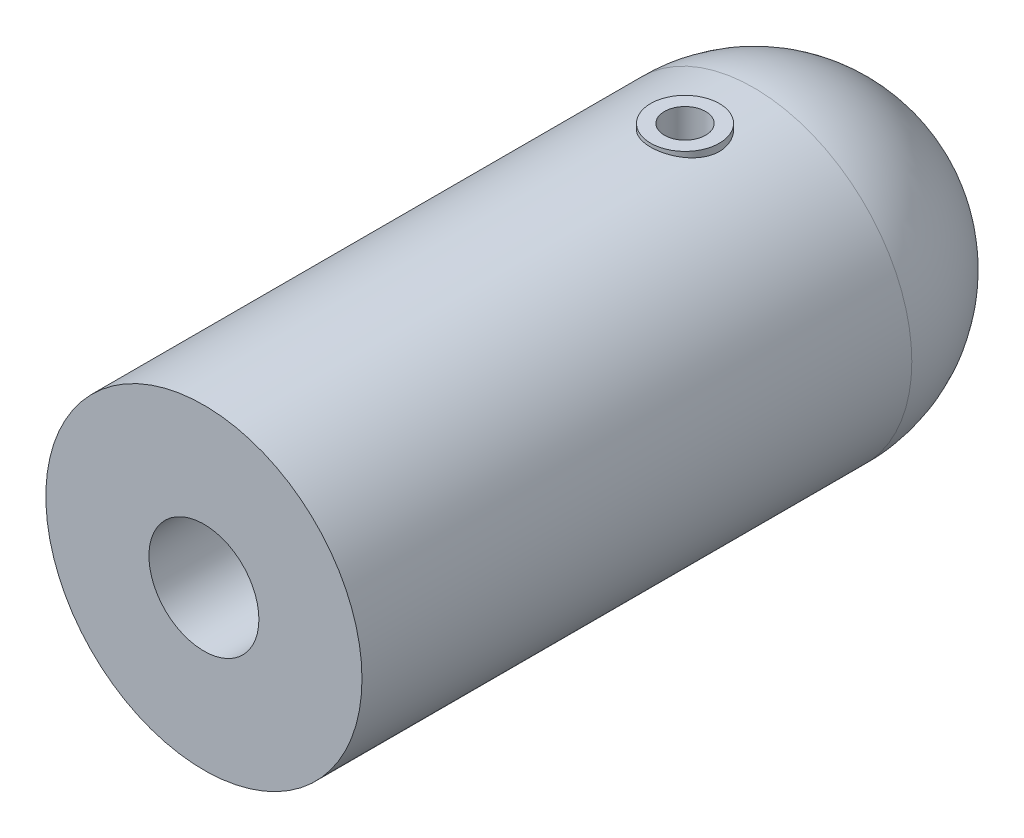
ISO-10303-21;
HEADER;
FILE_DESCRIPTION(('STEP AP214'),'2;1');
FILE_NAME('part.step','',(''),(''),'','','');
FILE_SCHEMA(('AUTOMOTIVE_DESIGN { 1 0 10303 214 1 1 1 1 }'));
ENDSEC;
DATA;
#1=APPLICATION_CONTEXT('core data for automotive mechanical design processes');
#2=APPLICATION_PROTOCOL_DEFINITION('international standard','automotive_design',2000,#1);
#3=PRODUCT_CONTEXT('',#1,'mechanical');
#4=PRODUCT('Part','Part','',(#3));
#5=PRODUCT_RELATED_PRODUCT_CATEGORY('part','',(#4));
#6=PRODUCT_DEFINITION_FORMATION('','',#4);
#7=PRODUCT_DEFINITION_CONTEXT('part definition',#1,'design');
#8=PRODUCT_DEFINITION('design','',#6,#7);
#9=PRODUCT_DEFINITION_SHAPE('','',#8);
#10=(LENGTH_UNIT() NAMED_UNIT(*) SI_UNIT(.MILLI.,.METRE.));
#11=(NAMED_UNIT(*) PLANE_ANGLE_UNIT() SI_UNIT($,.RADIAN.));
#12=(NAMED_UNIT(*) SI_UNIT($,.STERADIAN.) SOLID_ANGLE_UNIT());
#13=UNCERTAINTY_MEASURE_WITH_UNIT(LENGTH_MEASURE(1.E-05),#10,'distance_accuracy_value','');
#14=(GEOMETRIC_REPRESENTATION_CONTEXT(3) GLOBAL_UNCERTAINTY_ASSIGNED_CONTEXT((#13)) GLOBAL_UNIT_ASSIGNED_CONTEXT((#10,
#11,#12)) REPRESENTATION_CONTEXT('',''));
#15=CARTESIAN_POINT('',(0.,0.,0.));
#16=DIRECTION('',(0.,0.,1.));
#17=DIRECTION('',(1.,0.,0.));
#18=AXIS2_PLACEMENT_3D('',#15,#16,#17);
#19=CARTESIAN_POINT('',(0.,0.,80.));
#20=DIRECTION('',(0.,0.,-1.));
#21=DIRECTION('',(-1.,0.,0.));
#22=AXIS2_PLACEMENT_3D('',#19,#20,#21);
#23=CYLINDRICAL_SURFACE('',#22,23.);
#24=CARTESIAN_POINT('',(0.,0.,0.));
#25=DIRECTION('',(0.,0.,1.));
#26=DIRECTION('',(1.,0.,0.));
#27=AXIS2_PLACEMENT_3D('',#24,#25,#26);
#28=CIRCLE('',#27,23.);
#29=CARTESIAN_POINT('',(23.,0.,0.));
#30=VERTEX_POINT('',#29);
#31=EDGE_CURVE('E67',#30,#30,#28,.T.);
#32=ORIENTED_EDGE('',*,*,#31,.T.);
#33=EDGE_LOOP('',(#32));
#34=FACE_BOUND('',#33,.T.);
#35=CARTESIAN_POINT('',(0.,0.,80.));
#36=DIRECTION('',(0.,0.,1.));
#37=DIRECTION('',(1.,0.,0.));
#38=AXIS2_PLACEMENT_3D('',#35,#36,#37);
#39=CIRCLE('',#38,23.);
#40=CARTESIAN_POINT('',(23.,0.,80.));
#41=VERTEX_POINT('',#40);
#42=EDGE_CURVE('E41',#41,#41,#39,.T.);
#43=ORIENTED_EDGE('',*,*,#42,.F.);
#44=EDGE_LOOP('',(#43));
#45=FACE_BOUND('',#44,.T.);
#46=CARTESIAN_POINT('',(0.,23.,15.));
#47=CARTESIAN_POINT('',(0.277355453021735,22.9999948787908,14.9999904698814));
#48=CARTESIAN_POINT('',(0.554826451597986,22.9949320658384,14.9768442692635));
#49=CARTESIAN_POINT('',(1.10188982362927,22.9752244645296,14.8849654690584));
#50=CARTESIAN_POINT('',(1.37147637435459,22.9605727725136,14.8162000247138));
#51=CARTESIAN_POINT('',(1.89478531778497,22.9233191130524,14.6353360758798));
#52=CARTESIAN_POINT('',(2.14852386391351,22.9007254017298,14.523282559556));
#53=CARTESIAN_POINT('',(2.63358953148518,22.8500275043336,14.2591653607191));
#54=CARTESIAN_POINT('',(2.86491728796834,22.8219234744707,14.1071028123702));
#55=CARTESIAN_POINT('',(3.30227374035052,22.7627863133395,13.7647311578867));
#56=CARTESIAN_POINT('',(3.50789604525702,22.7317172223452,13.5739090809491));
#57=CARTESIAN_POINT('',(3.8844813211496,22.6704056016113,13.1605364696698));
#58=CARTESIAN_POINT('',(4.05544123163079,22.6401631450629,12.9379831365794));
#59=CARTESIAN_POINT('',(4.35963714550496,22.5835746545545,12.4644667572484));
#60=CARTESIAN_POINT('',(4.49244139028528,22.557274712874,12.2132203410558));
#61=CARTESIAN_POINT('',(4.7137868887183,22.5120647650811,11.6913104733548));
#62=CARTESIAN_POINT('',(4.8023333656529,22.4931538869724,11.4206493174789));
#63=CARTESIAN_POINT('',(4.93130849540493,22.4652292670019,10.8719987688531));
#64=CARTESIAN_POINT('',(4.97245619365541,22.4560677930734,10.5941860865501));
#65=CARTESIAN_POINT('',(5.00770133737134,22.4482355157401,10.0354611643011));
#66=CARTESIAN_POINT('',(5.00180449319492,22.4495634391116,9.75454930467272));
#67=CARTESIAN_POINT('',(4.94370678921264,22.462426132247,9.20293933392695));
#68=CARTESIAN_POINT('',(4.89234041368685,22.473776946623,8.93214839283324));
#69=CARTESIAN_POINT('',(4.74608346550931,22.5051157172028,8.40312176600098));
#70=CARTESIAN_POINT('',(4.65119047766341,22.5251041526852,8.14488677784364));
#71=CARTESIAN_POINT('',(4.41980547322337,22.5716477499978,7.64595211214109));
#72=CARTESIAN_POINT('',(4.28299185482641,22.5982533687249,7.40540648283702));
#73=CARTESIAN_POINT('',(3.97187541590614,22.6550024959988,6.95037821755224));
#74=CARTESIAN_POINT('',(3.79756754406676,22.685146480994,6.73589909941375));
#75=CARTESIAN_POINT('',(3.41198948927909,22.7463657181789,6.33428694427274));
#76=CARTESIAN_POINT('',(3.20000952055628,22.7774471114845,6.14783562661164));
#77=CARTESIAN_POINT('',(2.74743924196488,22.8364526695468,5.81301931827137));
#78=CARTESIAN_POINT('',(2.50684842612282,22.8643767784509,5.66465500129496));
#79=CARTESIAN_POINT('',(2.00305938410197,22.9140103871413,5.41005890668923));
#80=CARTESIAN_POINT('',(1.73981507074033,22.9357068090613,5.30391561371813));
#81=CARTESIAN_POINT('',(1.19865085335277,22.9703430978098,5.13755845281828));
#82=CARTESIAN_POINT('',(0.920733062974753,22.9832842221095,5.07733798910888));
#83=CARTESIAN_POINT('',(0.363959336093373,22.998773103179,5.0055255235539));
#84=CARTESIAN_POINT('',(0.0852289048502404,23.0015198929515,4.99300216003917));
#85=CARTESIAN_POINT('',(-0.470341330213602,22.9968679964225,5.01441617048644));
#86=CARTESIAN_POINT('',(-0.747181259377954,22.9894699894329,5.04835043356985));
#87=CARTESIAN_POINT('',(-1.28803214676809,22.965485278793,5.16094402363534));
#88=CARTESIAN_POINT('',(-1.55214947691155,22.9489988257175,5.23911563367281));
#89=CARTESIAN_POINT('',(-2.06352339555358,22.908682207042,5.43742418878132));
#90=CARTESIAN_POINT('',(-2.31077855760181,22.8848514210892,5.55756467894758));
#91=CARTESIAN_POINT('',(-2.78526633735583,22.8319982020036,5.83834667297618));
#92=CARTESIAN_POINT('',(-3.01216677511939,22.8029071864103,5.99953632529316));
#93=CARTESIAN_POINT('',(-3.43603237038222,22.7429019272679,6.35711834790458));
#94=CARTESIAN_POINT('',(-3.63299368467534,22.7119874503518,6.55351523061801));
#95=CARTESIAN_POINT('',(-3.99506577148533,22.6511332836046,6.98020810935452));
#96=CARTESIAN_POINT('',(-4.15953201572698,22.6212215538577,7.21105574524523));
#97=CARTESIAN_POINT('',(-4.44736358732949,22.5664022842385,7.69764303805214));
#98=CARTESIAN_POINT('',(-4.57073068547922,22.5414945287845,7.95338162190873));
#99=CARTESIAN_POINT('',(-4.7720341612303,22.4997392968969,8.48112433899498));
#100=CARTESIAN_POINT('',(-4.8502247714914,22.4828468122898,8.75302776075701));
#101=CARTESIAN_POINT('',(-4.95970263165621,22.4589524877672,9.30652786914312));
#102=CARTESIAN_POINT('',(-4.99099727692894,22.4519490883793,9.58812302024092));
#103=CARTESIAN_POINT('',(-5.00548311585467,22.448723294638,10.1465166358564));
#104=CARTESIAN_POINT('',(-4.98969596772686,22.4522719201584,10.4232877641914));
#105=CARTESIAN_POINT('',(-4.91274819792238,22.4692329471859,10.9701251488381));
#106=CARTESIAN_POINT('',(-4.85158809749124,22.482645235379,11.2401914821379));
#107=CARTESIAN_POINT('',(-4.68612139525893,22.5177114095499,11.7651534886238));
#108=CARTESIAN_POINT('',(-4.5819617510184,22.5393372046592,12.0200974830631));
#109=CARTESIAN_POINT('',(-4.33357956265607,22.5884050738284,12.5090440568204));
#110=CARTESIAN_POINT('',(-4.1893529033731,22.6158477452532,12.7430444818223));
#111=CARTESIAN_POINT('',(-3.86153463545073,22.6741425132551,13.1885016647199));
#112=CARTESIAN_POINT('',(-3.67721419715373,22.7050517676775,13.3994146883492));
#113=CARTESIAN_POINT('',(-3.27591964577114,22.7664110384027,13.7876521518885));
#114=CARTESIAN_POINT('',(-3.05893799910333,22.796860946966,13.9649688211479));
#115=CARTESIAN_POINT('',(-2.59513904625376,22.8543320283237,14.283147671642));
#116=CARTESIAN_POINT('',(-2.34797586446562,22.8813044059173,14.4235149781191));
#117=CARTESIAN_POINT('',(-1.83303166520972,22.9282925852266,14.6604916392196));
#118=CARTESIAN_POINT('',(-1.56526825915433,22.948314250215,14.7571378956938));
#119=CARTESIAN_POINT('',(-1.08101000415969,22.9755491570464,14.8865936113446));
#120=CARTESIAN_POINT('',(-0.867145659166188,22.9846616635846,14.9290402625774));
#121=CARTESIAN_POINT('',(-0.435544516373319,22.9968889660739,14.9857465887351));
#122=CARTESIAN_POINT('',(-0.217807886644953,23.0000040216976,15.0000074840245));
#123=CARTESIAN_POINT('',(0.,23.,15.));
#124=B_SPLINE_CURVE_WITH_KNOTS('',3,(#46,#47,#48,#49,#50,#51,#52,#53,#54,#55,#56,#57,#58,#59,
#60,#61,#62,#63,#64,#65,#66,#67,#68,#69,#70,#71,#72,#73,#74,#75,#76,#77,#78,#79,#80,#81,#82,#83,
#84,#85,#86,#87,#88,#89,#90,#91,#92,#93,#94,#95,#96,#97,#98,#99,#100,#101,#102,#103,#104,#105,
#106,#107,#108,#109,#110,#111,#112,#113,#114,#115,#116,#117,#118,#119,#120,#121,#122,#123),
.UNSPECIFIED.,.T.,.F.,(4,2,2,2,2,2,2,2,2,2,2,2,2,2,2,2,2,2,2,2,2,2,2,2,2,2,2,2,2,2,2,2,2,2,2,2,
2,2,4),(0.,0.831269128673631,1.66313740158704,2.49414345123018,3.32512594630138,4.1679214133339,
5.01079126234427,5.8628536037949,6.71481536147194,7.55367510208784,8.39243302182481,
9.21610950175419,10.0398316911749,10.8700385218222,11.7003572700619,12.5484059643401,
13.3964696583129,14.2463014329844,15.0960111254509,15.9290411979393,16.7620154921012,
17.5859803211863,18.4100147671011,19.2456896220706,20.0814716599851,20.9324565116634,
21.7834046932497,22.6295162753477,23.4754944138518,24.3032496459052,25.1309953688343,
25.9559352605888,26.7809599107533,27.6224659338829,28.4641663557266,29.3166242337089,
30.1683612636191,30.8211871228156,31.4739847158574),.UNSPECIFIED.);
#125=CARTESIAN_POINT('',(0.,23.,15.));
#126=VERTEX_POINT('',#125);
#127=EDGE_CURVE('E74',#126,#126,#124,.T.);
#128=ORIENTED_EDGE('',*,*,#127,.F.);
#129=EDGE_LOOP('',(#128));
#130=FACE_BOUND('',#129,.T.);
#131=CARTESIAN_POINT('',(0.,-23.,5.));
#132=CARTESIAN_POINT('',(0.277355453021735,-22.9999948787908,5.00000953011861));
#133=CARTESIAN_POINT('',(0.554826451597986,-22.9949320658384,5.02315573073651));
#134=CARTESIAN_POINT('',(1.10188982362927,-22.9752244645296,5.11503453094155));
#135=CARTESIAN_POINT('',(1.37147637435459,-22.9605727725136,5.18379997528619));
#136=CARTESIAN_POINT('',(1.89478531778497,-22.9233191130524,5.36466392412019));
#137=CARTESIAN_POINT('',(2.14852386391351,-22.9007254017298,5.47671744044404));
#138=CARTESIAN_POINT('',(2.63358953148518,-22.8500275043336,5.74083463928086));
#139=CARTESIAN_POINT('',(2.86491728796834,-22.8219234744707,5.89289718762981));
#140=CARTESIAN_POINT('',(3.30227374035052,-22.7627863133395,6.23526884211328));
#141=CARTESIAN_POINT('',(3.50789604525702,-22.7317172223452,6.42609091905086));
#142=CARTESIAN_POINT('',(3.8844813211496,-22.6704056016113,6.83946353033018));
#143=CARTESIAN_POINT('',(4.05544123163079,-22.6401631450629,7.06201686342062));
#144=CARTESIAN_POINT('',(4.35963714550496,-22.5835746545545,7.53553324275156));
#145=CARTESIAN_POINT('',(4.49244139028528,-22.557274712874,7.78677965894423));
#146=CARTESIAN_POINT('',(4.7137868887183,-22.5120647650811,8.30868952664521));
#147=CARTESIAN_POINT('',(4.80233336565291,-22.4931538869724,8.57935068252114));
#148=CARTESIAN_POINT('',(4.93130849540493,-22.4652292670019,9.12800123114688));
#149=CARTESIAN_POINT('',(4.97245619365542,-22.4560677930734,9.4058139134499));
#150=CARTESIAN_POINT('',(5.00770133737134,-22.4482355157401,9.96453883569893));
#151=CARTESIAN_POINT('',(5.00180449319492,-22.4495634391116,10.2454506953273));
#152=CARTESIAN_POINT('',(4.94370678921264,-22.462426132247,10.797060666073));
#153=CARTESIAN_POINT('',(4.89234041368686,-22.473776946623,11.0678516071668));
#154=CARTESIAN_POINT('',(4.74608346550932,-22.5051157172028,11.596878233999));
#155=CARTESIAN_POINT('',(4.65119047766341,-22.5251041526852,11.8551132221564));
#156=CARTESIAN_POINT('',(4.41980547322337,-22.5716477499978,12.3540478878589));
#157=CARTESIAN_POINT('',(4.28299185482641,-22.5982533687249,12.594593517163));
#158=CARTESIAN_POINT('',(3.97187541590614,-22.6550024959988,13.0496217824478));
#159=CARTESIAN_POINT('',(3.79756754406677,-22.685146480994,13.2641009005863));
#160=CARTESIAN_POINT('',(3.41198948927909,-22.7463657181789,13.6657130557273));
#161=CARTESIAN_POINT('',(3.20000952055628,-22.7774471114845,13.8521643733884));
#162=CARTESIAN_POINT('',(2.74743924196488,-22.8364526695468,14.1869806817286));
#163=CARTESIAN_POINT('',(2.50684842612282,-22.8643767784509,14.335344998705));
#164=CARTESIAN_POINT('',(2.00305938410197,-22.9140103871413,14.5899410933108));
#165=CARTESIAN_POINT('',(1.73981507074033,-22.9357068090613,14.6960843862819));
#166=CARTESIAN_POINT('',(1.19865085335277,-22.9703430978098,14.8624415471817));
#167=CARTESIAN_POINT('',(0.920733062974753,-22.9832842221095,14.9226620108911));
#168=CARTESIAN_POINT('',(0.363959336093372,-22.998773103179,14.9944744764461));
#169=CARTESIAN_POINT('',(0.0852289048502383,-23.0015198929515,15.0069978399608));
#170=CARTESIAN_POINT('',(-0.470341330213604,-22.9968679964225,14.9855838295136));
#171=CARTESIAN_POINT('',(-0.747181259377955,-22.9894699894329,14.9516495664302));
#172=CARTESIAN_POINT('',(-1.28803214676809,-22.965485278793,14.8390559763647));
#173=CARTESIAN_POINT('',(-1.55214947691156,-22.9489988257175,14.7608843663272));
#174=CARTESIAN_POINT('',(-2.06352339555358,-22.908682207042,14.5625758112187));
#175=CARTESIAN_POINT('',(-2.31077855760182,-22.8848514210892,14.4424353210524));
#176=CARTESIAN_POINT('',(-2.78526633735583,-22.8319982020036,14.1616533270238));
#177=CARTESIAN_POINT('',(-3.01216677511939,-22.8029071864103,14.0004636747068));
#178=CARTESIAN_POINT('',(-3.43603237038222,-22.7429019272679,13.6428816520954));
#179=CARTESIAN_POINT('',(-3.63299368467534,-22.7119874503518,13.446484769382));
#180=CARTESIAN_POINT('',(-3.99506577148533,-22.6511332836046,13.0197918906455));
#181=CARTESIAN_POINT('',(-4.15953201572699,-22.6212215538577,12.7889442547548));
#182=CARTESIAN_POINT('',(-4.44736358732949,-22.5664022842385,12.3023569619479));
#183=CARTESIAN_POINT('',(-4.57073068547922,-22.5414945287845,12.0466183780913));
#184=CARTESIAN_POINT('',(-4.77203416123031,-22.4997392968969,11.518875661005));
#185=CARTESIAN_POINT('',(-4.8502247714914,-22.4828468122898,11.246972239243));
#186=CARTESIAN_POINT('',(-4.95970263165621,-22.4589524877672,10.6934721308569));
#187=CARTESIAN_POINT('',(-4.99099727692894,-22.4519490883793,10.4118769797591));
#188=CARTESIAN_POINT('',(-5.00548311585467,-22.448723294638,9.85348336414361));
#189=CARTESIAN_POINT('',(-4.98969596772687,-22.4522719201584,9.57671223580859));
#190=CARTESIAN_POINT('',(-4.91274819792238,-22.4692329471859,9.02987485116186));
#191=CARTESIAN_POINT('',(-4.85158809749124,-22.482645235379,8.75980851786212));
#192=CARTESIAN_POINT('',(-4.68612139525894,-22.5177114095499,8.23484651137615));
#193=CARTESIAN_POINT('',(-4.5819617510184,-22.5393372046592,7.9799025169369));
#194=CARTESIAN_POINT('',(-4.33357956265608,-22.5884050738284,7.49095594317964));
#195=CARTESIAN_POINT('',(-4.1893529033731,-22.6158477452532,7.25695551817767));
#196=CARTESIAN_POINT('',(-3.86153463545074,-22.6741425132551,6.81149833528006));
#197=CARTESIAN_POINT('',(-3.67721419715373,-22.7050517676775,6.60058531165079));
#198=CARTESIAN_POINT('',(-3.27591964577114,-22.7664110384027,6.21234784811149));
#199=CARTESIAN_POINT('',(-3.05893799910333,-22.796860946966,6.03503117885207));
#200=CARTESIAN_POINT('',(-2.59513904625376,-22.8543320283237,5.71685232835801));
#201=CARTESIAN_POINT('',(-2.34797586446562,-22.8813044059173,5.57648502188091));
#202=CARTESIAN_POINT('',(-1.83303166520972,-22.9282925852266,5.33950836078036));
#203=CARTESIAN_POINT('',(-1.56526825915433,-22.948314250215,5.24286210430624));
#204=CARTESIAN_POINT('',(-1.0810100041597,-22.9755491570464,5.11340638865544));
#205=CARTESIAN_POINT('',(-0.867145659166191,-22.9846616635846,5.07095973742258));
#206=CARTESIAN_POINT('',(-0.435544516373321,-22.9968889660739,5.01425341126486));
#207=CARTESIAN_POINT('',(-0.217807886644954,-23.0000040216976,4.99999251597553));
#208=CARTESIAN_POINT('',(0.,-23.,5.));
#209=B_SPLINE_CURVE_WITH_KNOTS('',3,(#131,#132,#133,#134,#135,#136,#137,#138,#139,#140,#141,
#142,#143,#144,#145,#146,#147,#148,#149,#150,#151,#152,#153,#154,#155,#156,#157,#158,#159,#160,
#161,#162,#163,#164,#165,#166,#167,#168,#169,#170,#171,#172,#173,#174,#175,#176,#177,#178,#179,
#180,#181,#182,#183,#184,#185,#186,#187,#188,#189,#190,#191,#192,#193,#194,#195,#196,#197,#198,
#199,#200,#201,#202,#203,#204,#205,#206,#207,#208),.UNSPECIFIED.,.T.,.F.,(4,2,2,2,2,2,2,2,2,2,2,
2,2,2,2,2,2,2,2,2,2,2,2,2,2,2,2,2,2,2,2,2,2,2,2,2,2,2,4),(0.,0.83126912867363,1.66313740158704,
2.49414345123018,3.32512594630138,4.1679214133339,5.01079126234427,5.8628536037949,
6.71481536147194,7.55367510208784,8.39243302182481,9.21610950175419,10.0398316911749,
10.8700385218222,11.7003572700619,12.5484059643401,13.3964696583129,14.2463014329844,
15.0960111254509,15.9290411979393,16.7620154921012,17.5859803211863,18.4100147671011,
19.2456896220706,20.0814716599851,20.9324565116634,21.7834046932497,22.6295162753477,
23.4754944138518,24.3032496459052,25.1309953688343,25.9559352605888,26.7809599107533,
27.6224659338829,28.4641663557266,29.3166242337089,30.1683612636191,30.8211871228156,
31.4739847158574),.UNSPECIFIED.);
#210=CARTESIAN_POINT('',(0.,-23.,5.));
#211=VERTEX_POINT('',#210);
#212=EDGE_CURVE('E11',#211,#211,#209,.T.);
#213=ORIENTED_EDGE('',*,*,#212,.F.);
#214=EDGE_LOOP('',(#213));
#215=FACE_BOUND('',#214,.T.);
#216=ADVANCED_FACE('F31',(#34,#45,#130,#215),#23,.T.);
#217=CARTESIAN_POINT('',(0.,0.,80.));
#218=DIRECTION('',(0.,0.,1.));
#219=DIRECTION('',(1.,0.,0.));
#220=AXIS2_PLACEMENT_3D('',#217,#218,#219);
#221=PLANE('',#220);
#222=CARTESIAN_POINT('',(0.,0.,80.));
#223=DIRECTION('',(0.,0.,1.));
#224=DIRECTION('',(1.,0.,0.));
#225=AXIS2_PLACEMENT_3D('',#222,#223,#224);
#226=CIRCLE('',#225,8.);
#227=CARTESIAN_POINT('',(8.,0.,80.));
#228=VERTEX_POINT('',#227);
#229=EDGE_CURVE('E119',#228,#228,#226,.T.);
#230=ORIENTED_EDGE('',*,*,#229,.F.);
#231=EDGE_LOOP('',(#230));
#232=FACE_BOUND('',#231,.T.);
#233=ORIENTED_EDGE('',*,*,#42,.T.);
#234=EDGE_LOOP('',(#233));
#235=FACE_BOUND('',#234,.T.);
#236=ADVANCED_FACE('F58',(#232,#235),#221,.T.);
#237=CARTESIAN_POINT('',(0.,0.,-9.99999999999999));
#238=DIRECTION('',(0.,0.,1.));
#239=DIRECTION('',(1.,0.,0.));
#240=AXIS2_PLACEMENT_3D('',#237,#238,#239);
#241=CYLINDRICAL_SURFACE('',#240,8.);
#242=CARTESIAN_POINT('',(0.,0.,0.));
#243=DIRECTION('',(0.,0.,1.));
#244=DIRECTION('',(1.,0.,0.));
#245=AXIS2_PLACEMENT_3D('',#242,#243,#244);
#246=CIRCLE('',#245,8.);
#247=CARTESIAN_POINT('',(8.,0.,0.));
#248=VERTEX_POINT('',#247);
#249=EDGE_CURVE('E122',#248,#248,#246,.T.);
#250=CARTESIAN_POINT('',(8.,0.,80.));
#251=CARTESIAN_POINT('',(8.,0.,79.1666666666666));
#252=CARTESIAN_POINT('',(8.,0.,78.3333333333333));
#253=CARTESIAN_POINT('',(8.,0.,76.6666666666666));
#254=CARTESIAN_POINT('',(8.,0.,75.8333333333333));
#255=CARTESIAN_POINT('',(8.,0.,74.1666666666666));
#256=CARTESIAN_POINT('',(8.,0.,73.3333333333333));
#257=CARTESIAN_POINT('',(8.,0.,71.6666666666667));
#258=CARTESIAN_POINT('',(8.,0.,70.8333333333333));
#259=CARTESIAN_POINT('',(8.,0.,69.1666666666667));
#260=CARTESIAN_POINT('',(8.,0.,68.3333333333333));
#261=CARTESIAN_POINT('',(8.,0.,66.6666666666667));
#262=CARTESIAN_POINT('',(8.,0.,65.8333333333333));
#263=CARTESIAN_POINT('',(8.,0.,64.1666666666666));
#264=CARTESIAN_POINT('',(8.,0.,63.3333333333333));
#265=CARTESIAN_POINT('',(8.,0.,61.6666666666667));
#266=CARTESIAN_POINT('',(8.,0.,60.8333333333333));
#267=CARTESIAN_POINT('',(8.,0.,59.1666666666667));
#268=CARTESIAN_POINT('',(8.,0.,58.3333333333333));
#269=CARTESIAN_POINT('',(8.,0.,56.6666666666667));
#270=CARTESIAN_POINT('',(8.,0.,55.8333333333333));
#271=CARTESIAN_POINT('',(8.,0.,54.1666666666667));
#272=CARTESIAN_POINT('',(8.,0.,53.3333333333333));
#273=CARTESIAN_POINT('',(8.,0.,51.6666666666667));
#274=CARTESIAN_POINT('',(8.,0.,50.8333333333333));
#275=CARTESIAN_POINT('',(8.,0.,49.1666666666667));
#276=CARTESIAN_POINT('',(8.,0.,48.3333333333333));
#277=CARTESIAN_POINT('',(8.,0.,46.6666666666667));
#278=CARTESIAN_POINT('',(8.,0.,45.8333333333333));
#279=CARTESIAN_POINT('',(8.,0.,44.1666666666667));
#280=CARTESIAN_POINT('',(8.,0.,43.3333333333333));
#281=CARTESIAN_POINT('',(8.,0.,41.6666666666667));
#282=CARTESIAN_POINT('',(8.,0.,40.8333333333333));
#283=CARTESIAN_POINT('',(8.,0.,39.1666666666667));
#284=CARTESIAN_POINT('',(8.,0.,38.3333333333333));
#285=CARTESIAN_POINT('',(8.,0.,36.6666666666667));
#286=CARTESIAN_POINT('',(8.,0.,35.8333333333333));
#287=CARTESIAN_POINT('',(8.,0.,34.1666666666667));
#288=CARTESIAN_POINT('',(8.,0.,33.3333333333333));
#289=CARTESIAN_POINT('',(8.,0.,31.6666666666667));
#290=CARTESIAN_POINT('',(8.,0.,30.8333333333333));
#291=CARTESIAN_POINT('',(8.,0.,29.1666666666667));
#292=CARTESIAN_POINT('',(8.,0.,28.3333333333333));
#293=CARTESIAN_POINT('',(8.,0.,26.6666666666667));
#294=CARTESIAN_POINT('',(8.,0.,25.8333333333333));
#295=CARTESIAN_POINT('',(8.,0.,24.1666666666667));
#296=CARTESIAN_POINT('',(8.,0.,23.3333333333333));
#297=CARTESIAN_POINT('',(8.,0.,21.6666666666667));
#298=CARTESIAN_POINT('',(8.,0.,20.8333333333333));
#299=CARTESIAN_POINT('',(8.,0.,19.1666666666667));
#300=CARTESIAN_POINT('',(8.,0.,18.3333333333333));
#301=CARTESIAN_POINT('',(8.,0.,16.6666666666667));
#302=CARTESIAN_POINT('',(8.,0.,15.8333333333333));
#303=CARTESIAN_POINT('',(8.,0.,14.1666666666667));
#304=CARTESIAN_POINT('',(8.,0.,13.3333333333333));
#305=CARTESIAN_POINT('',(8.,0.,11.6666666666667));
#306=CARTESIAN_POINT('',(8.,0.,10.8333333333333));
#307=CARTESIAN_POINT('',(8.,0.,9.16666666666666));
#308=CARTESIAN_POINT('',(8.,0.,8.33333333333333));
#309=CARTESIAN_POINT('',(8.,0.,6.66666666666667));
#310=CARTESIAN_POINT('',(8.,0.,5.83333333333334));
#311=CARTESIAN_POINT('',(8.,0.,4.16666666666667));
#312=CARTESIAN_POINT('',(8.,0.,3.33333333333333));
#313=CARTESIAN_POINT('',(8.,0.,1.66666666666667));
#314=CARTESIAN_POINT('',(8.,0.,0.833333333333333));
#315=CARTESIAN_POINT('',(8.,0.,0.));
#316=B_SPLINE_CURVE_WITH_KNOTS('',3,(#250,#251,#252,#253,#254,#255,#256,#257,#258,#259,#260,
#261,#262,#263,#264,#265,#266,#267,#268,#269,#270,#271,#272,#273,#274,#275,#276,#277,#278,#279,
#280,#281,#282,#283,#284,#285,#286,#287,#288,#289,#290,#291,#292,#293,#294,#295,#296,#297,#298,
#299,#300,#301,#302,#303,#304,#305,#306,#307,#308,#309,#310,#311,#312,#313,#314,#315),
.UNSPECIFIED.,.F.,.F.,(4,2,2,2,2,2,2,2,2,2,2,2,2,2,2,2,2,2,2,2,2,2,2,2,2,2,2,2,2,2,2,2,4),(0.,
2.5,5.,7.50000000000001,9.99999999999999,12.5,15.,17.5,20.,22.5,25.,27.5,30.,32.5,35.,37.5,40.,
42.5,45.,47.5,50.,52.5,55.,57.5,60.,62.5,65.,67.5,70.,72.5,75.,77.5,80.),.UNSPECIFIED.);
#317=EDGE_CURVE('BSEAM63',#228,#248,#316,.T.);
#318=ORIENTED_EDGE('',*,*,#229,.T.);
#319=ORIENTED_EDGE('',*,*,#249,.F.);
#320=ORIENTED_EDGE('',*,*,#317,.T.);
#321=ORIENTED_EDGE('',*,*,#317,.F.);
#322=EDGE_LOOP('',(#318,#320,#319,#321));
#323=FACE_BOUND('',#322,.T.);
#324=ADVANCED_FACE('F63',(#323),#241,.F.);
#325=CARTESIAN_POINT('',(0.,23.5,10.));
#326=DIRECTION('',(0.,1.,0.));
#327=DIRECTION('',(0.,0.,1.));
#328=AXIS2_PLACEMENT_3D('',#325,#326,#327);
#329=PLANE('',#328);
#330=CARTESIAN_POINT('',(0.,23.5,10.));
#331=DIRECTION('',(0.,1.,0.));
#332=DIRECTION('',(0.,0.,1.));
#333=AXIS2_PLACEMENT_3D('',#330,#331,#332);
#334=CIRCLE('',#333,3.);
#335=CARTESIAN_POINT('',(0.,23.5,13.));
#336=VERTEX_POINT('',#335);
#337=EDGE_CURVE('E141',#336,#336,#334,.T.);
#338=ORIENTED_EDGE('',*,*,#337,.F.);
#339=EDGE_LOOP('',(#338));
#340=FACE_BOUND('',#339,.T.);
#341=CARTESIAN_POINT('',(0.,23.5,10.));
#342=DIRECTION('',(0.,1.,0.));
#343=DIRECTION('',(0.,0.,1.));
#344=AXIS2_PLACEMENT_3D('',#341,#342,#343);
#345=CIRCLE('',#344,5.);
#346=CARTESIAN_POINT('',(0.,23.5,15.));
#347=VERTEX_POINT('',#346);
#348=EDGE_CURVE('E116',#347,#347,#345,.T.);
#349=ORIENTED_EDGE('',*,*,#348,.T.);
#350=EDGE_LOOP('',(#349));
#351=FACE_BOUND('',#350,.T.);
#352=ADVANCED_FACE('F82',(#340,#351),#329,.T.);
#353=CARTESIAN_POINT('',(0.,-500000.,10.));
#354=DIRECTION('',(0.,1.,0.));
#355=DIRECTION('',(0.,0.,1.));
#356=AXIS2_PLACEMENT_3D('',#353,#354,#355);
#357=CYLINDRICAL_SURFACE('',#356,5.);
#358=ORIENTED_EDGE('',*,*,#348,.F.);
#359=EDGE_LOOP('',(#358));
#360=FACE_BOUND('',#359,.T.);
#361=ORIENTED_EDGE('',*,*,#127,.T.);
#362=EDGE_LOOP('',(#361));
#363=FACE_BOUND('',#362,.T.);
#364=ADVANCED_FACE('F90',(#360,#363),#357,.T.);
#365=CARTESIAN_POINT('',(0.,-23.5,10.));
#366=DIRECTION('',(0.,1.,0.));
#367=DIRECTION('',(0.,0.,1.));
#368=AXIS2_PLACEMENT_3D('',#365,#366,#367);
#369=PLANE('',#368);
#370=CARTESIAN_POINT('',(0.,-23.5,10.));
#371=DIRECTION('',(0.,-1.,0.));
#372=DIRECTION('',(0.,0.,-1.));
#373=AXIS2_PLACEMENT_3D('',#370,#371,#372);
#374=CIRCLE('',#373,3.);
#375=CARTESIAN_POINT('',(0.,-23.5,7.));
#376=VERTEX_POINT('',#375);
#377=EDGE_CURVE('E135',#376,#376,#374,.T.);
#378=ORIENTED_EDGE('',*,*,#377,.F.);
#379=EDGE_LOOP('',(#378));
#380=FACE_BOUND('',#379,.T.);
#381=CARTESIAN_POINT('',(0.,-23.5,10.));
#382=DIRECTION('',(0.,1.,0.));
#383=DIRECTION('',(0.,0.,1.));
#384=AXIS2_PLACEMENT_3D('',#381,#382,#383);
#385=CIRCLE('',#384,5.);
#386=CARTESIAN_POINT('',(0.,-23.5,15.));
#387=VERTEX_POINT('',#386);
#388=EDGE_CURVE('E117',#387,#387,#385,.T.);
#389=ORIENTED_EDGE('',*,*,#388,.F.);
#390=EDGE_LOOP('',(#389));
#391=FACE_BOUND('',#390,.T.);
#392=ADVANCED_FACE('F80',(#380,#391),#369,.F.);
#393=CARTESIAN_POINT('',(0.,500000.,10.));
#394=DIRECTION('',(0.,-1.,0.));
#395=DIRECTION('',(0.,0.,-1.));
#396=AXIS2_PLACEMENT_3D('',#393,#394,#395);
#397=CYLINDRICAL_SURFACE('',#396,5.);
#398=ORIENTED_EDGE('',*,*,#388,.T.);
#399=EDGE_LOOP('',(#398));
#400=FACE_BOUND('',#399,.T.);
#401=ORIENTED_EDGE('',*,*,#212,.T.);
#402=EDGE_LOOP('',(#401));
#403=FACE_BOUND('',#402,.T.);
#404=ADVANCED_FACE('F77',(#400,#403),#397,.T.);
#405=CARTESIAN_POINT('',(0.,-13.5,10.));
#406=DIRECTION('',(0.,-1.,0.));
#407=DIRECTION('',(0.,0.,-1.));
#408=AXIS2_PLACEMENT_3D('',#405,#406,#407);
#409=CYLINDRICAL_SURFACE('',#408,3.);
#410=CARTESIAN_POINT('',(0.,-13.5,10.));
#411=DIRECTION('',(0.,-1.,0.));
#412=DIRECTION('',(0.,0.,-1.));
#413=AXIS2_PLACEMENT_3D('',#410,#411,#412);
#414=CIRCLE('',#413,3.);
#415=CARTESIAN_POINT('',(0.,-13.5,7.));
#416=VERTEX_POINT('',#415);
#417=EDGE_CURVE('E132',#416,#416,#414,.T.);
#418=ORIENTED_EDGE('',*,*,#417,.F.);
#419=EDGE_LOOP('',(#418));
#420=FACE_BOUND('',#419,.T.);
#421=ORIENTED_EDGE('',*,*,#377,.T.);
#422=EDGE_LOOP('',(#421));
#423=FACE_BOUND('',#422,.T.);
#424=ADVANCED_FACE('F79',(#420,#423),#409,.F.);
#425=CARTESIAN_POINT('',(0.,-13.5,10.));
#426=DIRECTION('',(0.,-1.,0.));
#427=DIRECTION('',(0.,0.,-1.));
#428=AXIS2_PLACEMENT_3D('',#425,#426,#427);
#429=PLANE('',#428);
#430=ORIENTED_EDGE('',*,*,#417,.T.);
#431=EDGE_LOOP('',(#430));
#432=FACE_BOUND('',#431,.T.);
#433=ADVANCED_FACE('F87',(#432),#429,.T.);
#434=CARTESIAN_POINT('',(0.,13.5,10.));
#435=DIRECTION('',(0.,1.,0.));
#436=DIRECTION('',(0.,0.,1.));
#437=AXIS2_PLACEMENT_3D('',#434,#435,#436);
#438=CYLINDRICAL_SURFACE('',#437,3.);
#439=CARTESIAN_POINT('',(0.,13.5,10.));
#440=DIRECTION('',(0.,1.,0.));
#441=DIRECTION('',(0.,0.,1.));
#442=AXIS2_PLACEMENT_3D('',#439,#440,#441);
#443=CIRCLE('',#442,3.);
#444=CARTESIAN_POINT('',(0.,13.5,13.));
#445=VERTEX_POINT('',#444);
#446=EDGE_CURVE('E138',#445,#445,#443,.T.);
#447=ORIENTED_EDGE('',*,*,#446,.F.);
#448=EDGE_LOOP('',(#447));
#449=FACE_BOUND('',#448,.T.);
#450=ORIENTED_EDGE('',*,*,#337,.T.);
#451=EDGE_LOOP('',(#450));
#452=FACE_BOUND('',#451,.T.);
#453=ADVANCED_FACE('F145',(#449,#452),#438,.F.);
#454=CARTESIAN_POINT('',(0.,13.5,10.));
#455=DIRECTION('',(0.,1.,0.));
#456=DIRECTION('',(0.,0.,1.));
#457=AXIS2_PLACEMENT_3D('',#454,#455,#456);
#458=PLANE('',#457);
#459=ORIENTED_EDGE('',*,*,#446,.T.);
#460=EDGE_LOOP('',(#459));
#461=FACE_BOUND('',#460,.T.);
#462=ADVANCED_FACE('F52',(#461),#458,.T.);
#463=CARTESIAN_POINT('',(-23.,0.,0.));
#464=DIRECTION('',(0.,0.,-1.));
#465=DIRECTION('',(-1.,0.,0.));
#466=AXIS2_PLACEMENT_3D('',#463,#464,#465);
#467=PLANE('',#466);
#468=ORIENTED_EDGE('',*,*,#249,.T.);
#469=EDGE_LOOP('',(#468));
#470=FACE_BOUND('',#469,.T.);
#471=ADVANCED_FACE('F46',(#470),#467,.F.);
#472=CARTESIAN_POINT('',(-0.0848648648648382,0.,-0.0848648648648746));
#473=DIRECTION('',(0.,-1.,0.));
#474=DIRECTION('',(1.,0.,0.));
#475=AXIS2_PLACEMENT_3D('',#472,#473,#474);
#476=CIRCLE('',#475,23.0850208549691);
#477=TRIMMED_CURVE('',#476,(PARAMETER_VALUE(-1.567120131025)),(PARAMETER_VALUE(1.567120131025)),
.T.,.PARAMETER.);
#478=CARTESIAN_POINT('',(0.,0.,-0.0848648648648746));
#479=DIRECTION('',(0.,0.,1.));
#480=AXIS1_PLACEMENT('',#478,#479);
#481=SURFACE_OF_REVOLUTION('',#477,#480);
#482=ORIENTED_EDGE('',*,*,#31,.F.);
#483=EDGE_LOOP('',(#482));
#484=FACE_BOUND('',#483,.T.);
#485=CARTESIAN_POINT('',(0.,0.,-23.1697297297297));
#486=VERTEX_POINT('',#485);
#487=VERTEX_LOOP('',#486);
#488=FACE_BOUND('',#487,.T.);
#489=ADVANCED_FACE('F44',(#484,#488),#481,.T.);
#490=CLOSED_SHELL('',(#216,#236,#324,#352,#364,#392,#404,#424,#433,#453,#462,#471,#489));
#491=MANIFOLD_SOLID_BREP('B2',#490);
#492=ADVANCED_BREP_SHAPE_REPRESENTATION('',(#18,#491),#14);
#493=SHAPE_DEFINITION_REPRESENTATION(#9,#492);
ENDSEC;
END-ISO-10303-21;
